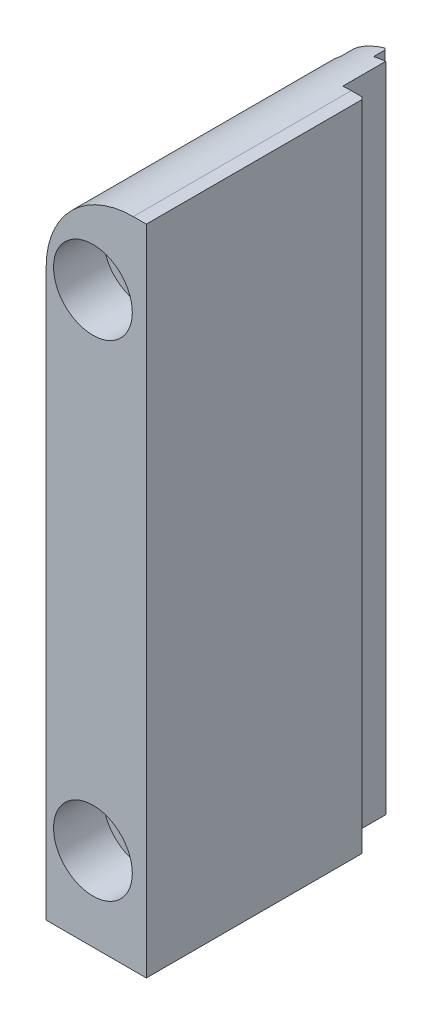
ISO-10303-21;
HEADER;
FILE_DESCRIPTION(('STEP AP214'),'2;1');
FILE_NAME('part.step','',(''),(''),'','','');
FILE_SCHEMA(('AUTOMOTIVE_DESIGN { 1 0 10303 214 1 1 1 1 }'));
ENDSEC;
DATA;
#1=APPLICATION_CONTEXT('core data for automotive mechanical design processes');
#2=APPLICATION_PROTOCOL_DEFINITION('international standard','automotive_design',2000,#1);
#3=PRODUCT_CONTEXT('',#1,'mechanical');
#4=PRODUCT('Part','Part','',(#3));
#5=PRODUCT_RELATED_PRODUCT_CATEGORY('part','',(#4));
#6=PRODUCT_DEFINITION_FORMATION('','',#4);
#7=PRODUCT_DEFINITION_CONTEXT('part definition',#1,'design');
#8=PRODUCT_DEFINITION('design','',#6,#7);
#9=PRODUCT_DEFINITION_SHAPE('','',#8);
#10=(LENGTH_UNIT() NAMED_UNIT(*) SI_UNIT(.MILLI.,.METRE.));
#11=(NAMED_UNIT(*) PLANE_ANGLE_UNIT() SI_UNIT($,.RADIAN.));
#12=(NAMED_UNIT(*) SI_UNIT($,.STERADIAN.) SOLID_ANGLE_UNIT());
#13=UNCERTAINTY_MEASURE_WITH_UNIT(LENGTH_MEASURE(1.E-05),#10,'distance_accuracy_value','');
#14=(GEOMETRIC_REPRESENTATION_CONTEXT(3) GLOBAL_UNCERTAINTY_ASSIGNED_CONTEXT((#13)) GLOBAL_UNIT_ASSIGNED_CONTEXT((#10,
#11,#12)) REPRESENTATION_CONTEXT('',''));
#15=CARTESIAN_POINT('',(0.,0.,0.));
#16=DIRECTION('',(0.,0.,1.));
#17=DIRECTION('',(1.,0.,0.));
#18=AXIS2_PLACEMENT_3D('',#15,#16,#17);
#19=CARTESIAN_POINT('',(-7.32028,29.845,-28.956));
#20=DIRECTION('',(0.,0.,-1.));
#21=DIRECTION('',(1.,0.,0.));
#22=AXIS2_PLACEMENT_3D('',#19,#20,#21);
#23=PLANE('',#22);
#24=CARTESIAN_POINT('',(-5.92328,-26.924,-28.956));
#25=DIRECTION('',(0.,0.,-1.));
#26=DIRECTION('',(-1.,0.,0.));
#27=AXIS2_PLACEMENT_3D('',#24,#25,#26);
#28=CIRCLE('',#27,2.7051);
#29=CARTESIAN_POINT('',(-8.62838,-26.924,-28.956));
#30=VERTEX_POINT('',#29);
#31=EDGE_CURVE('E291',#30,#30,#28,.T.);
#32=ORIENTED_EDGE('',*,*,#31,.F.);
#33=EDGE_LOOP('',(#32));
#34=FACE_BOUND('',#33,.T.);
#35=CARTESIAN_POINT('',(-5.92328,26.924,-28.956));
#36=DIRECTION('',(0.,0.,-1.));
#37=DIRECTION('',(-1.,0.,0.));
#38=AXIS2_PLACEMENT_3D('',#35,#36,#37);
#39=CIRCLE('',#38,2.7051);
#40=CARTESIAN_POINT('',(-8.62838,26.924,-28.956));
#41=VERTEX_POINT('',#40);
#42=EDGE_CURVE('E423',#41,#41,#39,.T.);
#43=ORIENTED_EDGE('',*,*,#42,.F.);
#44=EDGE_LOOP('',(#43));
#45=FACE_BOUND('',#44,.T.);
#46=CARTESIAN_POINT('',(-5.92328,26.924,-28.956));
#47=DIRECTION('',(0.,0.,1.));
#48=DIRECTION('',(1.,0.,0.));
#49=AXIS2_PLACEMENT_3D('',#46,#47,#48);
#50=CIRCLE('',#49,3.175);
#51=CARTESIAN_POINT('',(-2.74828,26.924,-28.956));
#52=VERTEX_POINT('',#51);
#53=CARTESIAN_POINT('',(-2.7482803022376,26.9226146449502,-28.956));
#54=VERTEX_POINT('',#53);
#55=EDGE_CURVE('E428',#52,#54,#50,.T.);
#56=ORIENTED_EDGE('',*,*,#55,.F.);
#57=DIRECTION('',(-1.,0.,0.));
#58=VECTOR('',#57,1.);
#59=CARTESIAN_POINT('',(-7.32028,26.924,-28.956));
#60=LINE('',#59,#58);
#61=CARTESIAN_POINT('',(-2.748026,26.924,-28.956));
#62=VERTEX_POINT('',#61);
#63=EDGE_CURVE('E476',#52,#62,#60,.F.);
#64=ORIENTED_EDGE('',*,*,#63,.T.);
#65=CARTESIAN_POINT('',(-5.92328,26.924,-28.956));
#66=DIRECTION('',(0.,0.,-1.));
#67=DIRECTION('',(-1.,0.,0.));
#68=AXIS2_PLACEMENT_3D('',#65,#66,#67);
#69=CIRCLE('',#68,3.175254);
#70=CARTESIAN_POINT('',(-3.76428,29.2522948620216,-28.956));
#71=VERTEX_POINT('',#70);
#72=EDGE_CURVE('E496',#71,#62,#69,.T.);
#73=ORIENTED_EDGE('',*,*,#72,.F.);
#74=DIRECTION('',(0.,-1.,0.));
#75=VECTOR('',#74,1.);
#76=CARTESIAN_POINT('',(-3.76428,29.845,-28.956));
#77=LINE('',#76,#75);
#78=CARTESIAN_POINT('',(-3.76428,35.9141543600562,-28.956));
#79=VERTEX_POINT('',#78);
#80=EDGE_CURVE('E365',#79,#71,#77,.T.);
#81=ORIENTED_EDGE('',*,*,#80,.F.);
#82=CARTESIAN_POINT('',(-1.45288,26.543,-28.956));
#83=DIRECTION('',(0.,0.,1.));
#84=DIRECTION('',(1.,0.,0.));
#85=AXIS2_PLACEMENT_3D('',#82,#83,#84);
#86=CIRCLE('',#85,9.652);
#87=CARTESIAN_POINT('',(-2.40538,36.1478866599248,-28.956));
#88=VERTEX_POINT('',#87);
#89=EDGE_CURVE('E334',#88,#79,#86,.T.);
#90=ORIENTED_EDGE('',*,*,#89,.F.);
#91=DIRECTION('',(0.,-1.,0.));
#92=VECTOR('',#91,1.);
#93=CARTESIAN_POINT('',(-2.40538,29.845,-28.956));
#94=LINE('',#93,#92);
#95=CARTESIAN_POINT('',(-2.40538,-36.195,-28.956));
#96=VERTEX_POINT('',#95);
#97=EDGE_CURVE('E368',#88,#96,#94,.T.);
#98=ORIENTED_EDGE('',*,*,#97,.T.);
#99=DIRECTION('',(-1.,0.,0.));
#100=VECTOR('',#99,1.);
#101=CARTESIAN_POINT('',(-11.07948,-36.195,-28.956));
#102=LINE('',#101,#100);
#103=CARTESIAN_POINT('',(-3.76428,-36.195,-28.956));
#104=VERTEX_POINT('',#103);
#105=EDGE_CURVE('E391',#96,#104,#102,.T.);
#106=ORIENTED_EDGE('',*,*,#105,.T.);
#107=CARTESIAN_POINT('',(-3.76428,-29.2522948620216,-28.956));
#108=VERTEX_POINT('',#107);
#109=EDGE_CURVE('E358',#108,#104,#77,.T.);
#110=ORIENTED_EDGE('',*,*,#109,.F.);
#111=CARTESIAN_POINT('',(-5.92328,-26.924,-28.956));
#112=DIRECTION('',(0.,0.,-1.));
#113=DIRECTION('',(-1.,0.,0.));
#114=AXIS2_PLACEMENT_3D('',#111,#112,#113);
#115=CIRCLE('',#114,3.175254);
#116=CARTESIAN_POINT('',(-2.74802630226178,-26.9253854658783,-28.956));
#117=VERTEX_POINT('',#116);
#118=EDGE_CURVE('E447',#117,#108,#115,.T.);
#119=ORIENTED_EDGE('',*,*,#118,.F.);
#120=DIRECTION('',(-0.999999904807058,0.000436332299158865,0.));
#121=VECTOR('',#120,1.);
#122=CARTESIAN_POINT('',(-7.34504987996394,-26.9233796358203,-28.956));
#123=LINE('',#122,#121);
#124=CARTESIAN_POINT('',(-2.7482803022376,-26.9253853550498,-28.956));
#125=VERTEX_POINT('',#124);
#126=EDGE_CURVE('E433',#117,#125,#123,.T.);
#127=ORIENTED_EDGE('',*,*,#126,.T.);
#128=CARTESIAN_POINT('',(-5.92328,-26.924,-28.956));
#129=DIRECTION('',(0.,0.,1.));
#130=DIRECTION('',(1.,0.,0.));
#131=AXIS2_PLACEMENT_3D('',#128,#129,#130);
#132=CIRCLE('',#131,3.175);
#133=CARTESIAN_POINT('',(-2.74828,-26.924,-28.956));
#134=VERTEX_POINT('',#133);
#135=EDGE_CURVE('E426',#134,#125,#132,.T.);
#136=ORIENTED_EDGE('',*,*,#135,.F.);
#137=DIRECTION('',(-1.,0.,0.));
#138=VECTOR('',#137,1.);
#139=CARTESIAN_POINT('',(-7.32028,-26.924,-28.956));
#140=LINE('',#139,#138);
#141=CARTESIAN_POINT('',(-2.748026,-26.924,-28.956));
#142=VERTEX_POINT('',#141);
#143=EDGE_CURVE('E430',#134,#142,#140,.F.);
#144=ORIENTED_EDGE('',*,*,#143,.T.);
#145=CARTESIAN_POINT('',(-3.76428,-24.5957051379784,-28.956));
#146=VERTEX_POINT('',#145);
#147=EDGE_CURVE('E436',#146,#142,#115,.T.);
#148=ORIENTED_EDGE('',*,*,#147,.F.);
#149=CARTESIAN_POINT('',(-3.76428,24.5957051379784,-28.956));
#150=VERTEX_POINT('',#149);
#151=EDGE_CURVE('E369',#150,#146,#77,.T.);
#152=ORIENTED_EDGE('',*,*,#151,.F.);
#153=CARTESIAN_POINT('',(-2.74802630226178,26.9226145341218,-28.956));
#154=VERTEX_POINT('',#153);
#155=EDGE_CURVE('E480',#154,#150,#69,.T.);
#156=ORIENTED_EDGE('',*,*,#155,.F.);
#157=DIRECTION('',(-0.999999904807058,0.000436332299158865,0.));
#158=VECTOR('',#157,1.);
#159=CARTESIAN_POINT('',(-7.32155426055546,26.9246101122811,-28.956));
#160=LINE('',#159,#158);
#161=EDGE_CURVE('E249',#154,#54,#160,.T.);
#162=ORIENTED_EDGE('',*,*,#161,.T.);
#163=EDGE_LOOP('',(#56,#64,#73,#81,#90,#98,#106,#110,#119,#127,#136,#144,#148,#152,#156,#162));
#164=FACE_BOUND('',#163,.T.);
#165=ADVANCED_FACE('F15',(#34,#45,#164),#23,.T.);
#166=CARTESIAN_POINT('',(-5.92328,26.924,-18.5166));
#167=DIRECTION('',(0.,0.,1.));
#168=DIRECTION('',(1.,0.,0.));
#169=AXIS2_PLACEMENT_3D('',#166,#167,#168);
#170=CONICAL_SURFACE('',#169,3.3147,0.785398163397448);
#171=CARTESIAN_POINT('',(-5.92328,26.924,-19.1262));
#172=DIRECTION('',(0.,0.,1.));
#173=DIRECTION('',(1.,0.,0.));
#174=AXIS2_PLACEMENT_3D('',#171,#172,#173);
#175=CIRCLE('',#174,2.7051);
#176=CARTESIAN_POINT('',(-3.21818,26.924,-19.1262));
#177=VERTEX_POINT('',#176);
#178=EDGE_CURVE('E276',#177,#177,#175,.T.);
#179=ORIENTED_EDGE('',*,*,#178,.F.);
#180=EDGE_LOOP('',(#179));
#181=FACE_BOUND('',#180,.T.);
#182=CARTESIAN_POINT('',(-5.92328,26.924,-18.5166));
#183=DIRECTION('',(0.,0.,-1.));
#184=DIRECTION('',(-1.,0.,0.));
#185=AXIS2_PLACEMENT_3D('',#182,#183,#184);
#186=CIRCLE('',#185,3.3147);
#187=CARTESIAN_POINT('',(-9.23798,26.924,-18.5166));
#188=VERTEX_POINT('',#187);
#189=EDGE_CURVE('E288',#188,#188,#186,.T.);
#190=ORIENTED_EDGE('',*,*,#189,.F.);
#191=EDGE_LOOP('',(#190));
#192=FACE_BOUND('',#191,.T.);
#193=CARTESIAN_POINT('',(-5.92328,26.924,-18.6563));
#194=DIRECTION('',(0.,0.,1.));
#195=DIRECTION('',(1.,0.,0.));
#196=AXIS2_PLACEMENT_3D('',#193,#194,#195);
#197=CIRCLE('',#196,3.175);
#198=CARTESIAN_POINT('',(-2.7482803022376,26.9226146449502,-18.6563));
#199=VERTEX_POINT('',#198);
#200=CARTESIAN_POINT('',(-2.74828,26.924,-18.6563));
#201=VERTEX_POINT('',#200);
#202=EDGE_CURVE('E9',#199,#201,#197,.F.);
#203=ORIENTED_EDGE('',*,*,#202,.F.);
#204=DIRECTION('',(0.707106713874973,-0.000308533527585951,0.707106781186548));
#205=VECTOR('',#204,1.);
#206=CARTESIAN_POINT('',(-5.92328,26.924,-21.8313));
#207=LINE('',#206,#205);
#208=CARTESIAN_POINT('',(-2.74802630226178,26.9226145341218,-18.656046));
#209=VERTEX_POINT('',#208);
#210=EDGE_CURVE('E241',#209,#199,#207,.F.);
#211=ORIENTED_EDGE('',*,*,#210,.F.);
#212=CARTESIAN_POINT('',(-5.92328,26.924,-18.656046));
#213=DIRECTION('',(0.,0.,1.));
#214=DIRECTION('',(1.,0.,0.));
#215=AXIS2_PLACEMENT_3D('',#212,#213,#214);
#216=CIRCLE('',#215,3.175254);
#217=CARTESIAN_POINT('',(-2.748026,26.924,-18.656046));
#218=VERTEX_POINT('',#217);
#219=EDGE_CURVE('E233',#209,#218,#216,.F.);
#220=ORIENTED_EDGE('',*,*,#219,.T.);
#221=DIRECTION('',(0.707106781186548,0.,0.707106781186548));
#222=VECTOR('',#221,1.);
#223=CARTESIAN_POINT('',(-5.92328,26.924,-21.8313));
#224=LINE('',#223,#222);
#225=EDGE_CURVE('E23',#201,#218,#224,.T.);
#226=ORIENTED_EDGE('',*,*,#225,.F.);
#227=EDGE_LOOP('',(#203,#211,#220,#226));
#228=FACE_BOUND('',#227,.T.);
#229=ADVANCED_FACE('F252',(#181,#192,#228),#170,.F.);
#230=CARTESIAN_POINT('',(-7.32028,24.0725742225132,-28.956));
#231=VERTEX_POINT('',#230);
#232=CARTESIAN_POINT('',(-7.32028,29.7754257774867,-28.956));
#233=VERTEX_POINT('',#232);
#234=EDGE_CURVE('E491',#231,#233,#69,.T.);
#235=ORIENTED_EDGE('',*,*,#234,.F.);
#236=DIRECTION('',(0.,-1.,0.));
#237=VECTOR('',#236,1.);
#238=CARTESIAN_POINT('',(-7.32028,29.845,-28.956));
#239=LINE('',#238,#237);
#240=CARTESIAN_POINT('',(-7.32028,-24.0725742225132,-28.956));
#241=VERTEX_POINT('',#240);
#242=EDGE_CURVE('E359',#231,#241,#239,.T.);
#243=ORIENTED_EDGE('',*,*,#242,.T.);
#244=CARTESIAN_POINT('',(-7.32028,-29.7754257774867,-28.956));
#245=VERTEX_POINT('',#244);
#246=EDGE_CURVE('E453',#245,#241,#115,.T.);
#247=ORIENTED_EDGE('',*,*,#246,.F.);
#248=CARTESIAN_POINT('',(-7.32028,-36.195,-28.956));
#249=VERTEX_POINT('',#248);
#250=EDGE_CURVE('E360',#245,#249,#239,.T.);
#251=ORIENTED_EDGE('',*,*,#250,.T.);
#252=DIRECTION('',(-1.,0.,0.));
#253=VECTOR('',#252,1.);
#254=CARTESIAN_POINT('',(-11.07948,-36.195,-28.956));
#255=LINE('',#254,#253);
#256=CARTESIAN_POINT('',(-11.10488,-36.195,-28.956));
#257=VERTEX_POINT('',#256);
#258=EDGE_CURVE('E320',#249,#257,#255,.T.);
#259=ORIENTED_EDGE('',*,*,#258,.T.);
#260=DIRECTION('',(0.,-1.,0.));
#261=VECTOR('',#260,1.);
#262=CARTESIAN_POINT('',(-11.10488,29.845,-28.956));
#263=LINE('',#262,#261);
#264=CARTESIAN_POINT('',(-11.10488,26.543,-28.956));
#265=VERTEX_POINT('',#264);
#266=EDGE_CURVE('E327',#265,#257,#263,.T.);
#267=ORIENTED_EDGE('',*,*,#266,.F.);
#268=CARTESIAN_POINT('',(-1.45288,26.543,-28.956));
#269=DIRECTION('',(0.,0.,1.));
#270=DIRECTION('',(1.,0.,0.));
#271=AXIS2_PLACEMENT_3D('',#268,#269,#270);
#272=CIRCLE('',#271,9.652);
#273=CARTESIAN_POINT('',(-7.32028,34.2068581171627,-28.956));
#274=VERTEX_POINT('',#273);
#275=EDGE_CURVE('E303',#274,#265,#272,.T.);
#276=ORIENTED_EDGE('',*,*,#275,.F.);
#277=EDGE_CURVE('E355',#274,#233,#239,.T.);
#278=ORIENTED_EDGE('',*,*,#277,.T.);
#279=EDGE_LOOP('',(#235,#243,#247,#251,#259,#267,#276,#278));
#280=FACE_BOUND('',#279,.T.);
#281=ADVANCED_FACE('F529',(#280),#23,.T.);
#282=CARTESIAN_POINT('',(-5.92328,-26.924,-18.5166));
#283=DIRECTION('',(0.,0.,1.));
#284=DIRECTION('',(1.,0.,0.));
#285=AXIS2_PLACEMENT_3D('',#282,#283,#284);
#286=CONICAL_SURFACE('',#285,3.3147,0.785398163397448);
#287=CARTESIAN_POINT('',(-5.92328,-26.924,-19.1262));
#288=DIRECTION('',(0.,0.,1.));
#289=DIRECTION('',(1.,0.,0.));
#290=AXIS2_PLACEMENT_3D('',#287,#288,#289);
#291=CIRCLE('',#290,2.7051);
#292=CARTESIAN_POINT('',(-3.21818,-26.924,-19.1262));
#293=VERTEX_POINT('',#292);
#294=EDGE_CURVE('E269',#293,#293,#291,.T.);
#295=ORIENTED_EDGE('',*,*,#294,.F.);
#296=EDGE_LOOP('',(#295));
#297=FACE_BOUND('',#296,.T.);
#298=CARTESIAN_POINT('',(-5.92328,-26.924,-18.5166));
#299=DIRECTION('',(0.,0.,-1.));
#300=DIRECTION('',(-1.,0.,0.));
#301=AXIS2_PLACEMENT_3D('',#298,#299,#300);
#302=CIRCLE('',#301,3.3147);
#303=CARTESIAN_POINT('',(-9.23798,-26.924,-18.5166));
#304=VERTEX_POINT('',#303);
#305=EDGE_CURVE('E273',#304,#304,#302,.T.);
#306=ORIENTED_EDGE('',*,*,#305,.F.);
#307=EDGE_LOOP('',(#306));
#308=FACE_BOUND('',#307,.T.);
#309=CARTESIAN_POINT('',(-5.92328,-26.924,-18.6563));
#310=DIRECTION('',(0.,0.,1.));
#311=DIRECTION('',(1.,0.,0.));
#312=AXIS2_PLACEMENT_3D('',#309,#310,#311);
#313=CIRCLE('',#312,3.175);
#314=CARTESIAN_POINT('',(-2.7482803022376,-26.9253853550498,-18.6563));
#315=VERTEX_POINT('',#314);
#316=CARTESIAN_POINT('',(-2.74828,-26.924,-18.6563));
#317=VERTEX_POINT('',#316);
#318=EDGE_CURVE('E242',#315,#317,#313,.F.);
#319=ORIENTED_EDGE('',*,*,#318,.F.);
#320=DIRECTION('',(0.707106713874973,-0.000308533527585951,0.707106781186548));
#321=VECTOR('',#320,1.);
#322=CARTESIAN_POINT('',(-5.92328,-26.924,-21.8313));
#323=LINE('',#322,#321);
#324=CARTESIAN_POINT('',(-2.74802630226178,-26.9253854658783,-18.656046));
#325=VERTEX_POINT('',#324);
#326=EDGE_CURVE('E259',#325,#315,#323,.F.);
#327=ORIENTED_EDGE('',*,*,#326,.F.);
#328=CARTESIAN_POINT('',(-5.92328,-26.924,-18.656046));
#329=DIRECTION('',(0.,0.,1.));
#330=DIRECTION('',(1.,0.,0.));
#331=AXIS2_PLACEMENT_3D('',#328,#329,#330);
#332=CIRCLE('',#331,3.175254);
#333=CARTESIAN_POINT('',(-2.748026,-26.924,-18.656046));
#334=VERTEX_POINT('',#333);
#335=EDGE_CURVE('E261',#325,#334,#332,.F.);
#336=ORIENTED_EDGE('',*,*,#335,.T.);
#337=DIRECTION('',(0.707106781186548,0.,0.707106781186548));
#338=VECTOR('',#337,1.);
#339=CARTESIAN_POINT('',(-5.92328,-26.924,-21.8313));
#340=LINE('',#339,#338);
#341=EDGE_CURVE('E256',#317,#334,#340,.T.);
#342=ORIENTED_EDGE('',*,*,#341,.F.);
#343=EDGE_LOOP('',(#319,#327,#336,#342));
#344=FACE_BOUND('',#343,.T.);
#345=ADVANCED_FACE('F17',(#297,#308,#344),#286,.F.);
#346=CARTESIAN_POINT('',(-3.76428,29.845,-28.956));
#347=DIRECTION('',(1.,0.,0.));
#348=DIRECTION('',(0.,0.,1.));
#349=AXIS2_PLACEMENT_3D('',#346,#347,#348);
#350=PLANE('',#349);
#351=DIRECTION('',(0.,0.,1.));
#352=VECTOR('',#351,1.);
#353=CARTESIAN_POINT('',(-3.76428,29.2522948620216,-18.5166));
#354=LINE('',#353,#352);
#355=CARTESIAN_POINT('',(-3.76428,29.2522948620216,-30.226));
#356=VERTEX_POINT('',#355);
#357=EDGE_CURVE('E498',#356,#71,#354,.T.);
#358=ORIENTED_EDGE('',*,*,#357,.F.);
#359=DIRECTION('',(0.,1.,0.));
#360=VECTOR('',#359,1.);
#361=CARTESIAN_POINT('',(-3.76428,29.845,-30.226));
#362=LINE('',#361,#360);
#363=CARTESIAN_POINT('',(-3.76428,35.9141543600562,-30.226));
#364=VERTEX_POINT('',#363);
#365=EDGE_CURVE('E299',#356,#364,#362,.T.);
#366=ORIENTED_EDGE('',*,*,#365,.T.);
#367=DIRECTION('',(0.,0.,1.));
#368=VECTOR('',#367,1.);
#369=CARTESIAN_POINT('',(-3.76428,35.9141543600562,-28.956));
#370=LINE('',#369,#368);
#371=EDGE_CURVE('E337',#79,#364,#370,.F.);
#372=ORIENTED_EDGE('',*,*,#371,.F.);
#373=ORIENTED_EDGE('',*,*,#80,.T.);
#374=EDGE_LOOP('',(#358,#366,#372,#373));
#375=FACE_BOUND('',#374,.T.);
#376=ADVANCED_FACE('F544',(#375),#350,.T.);
#377=CARTESIAN_POINT('',(-3.76428,29.845,-30.48));
#378=DIRECTION('',(0.,0.,-1.));
#379=DIRECTION('',(1.,0.,0.));
#380=AXIS2_PLACEMENT_3D('',#377,#378,#379);
#381=PLANE('',#380);
#382=CARTESIAN_POINT('',(-5.92328,26.924,-30.48));
#383=DIRECTION('',(0.,0.,-1.));
#384=DIRECTION('',(-1.,0.,0.));
#385=AXIS2_PLACEMENT_3D('',#382,#383,#384);
#386=CIRCLE('',#385,3.175254);
#387=CARTESIAN_POINT('',(-7.06628,29.886395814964,-30.48));
#388=VERTEX_POINT('',#387);
#389=CARTESIAN_POINT('',(-4.01828,29.4643174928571,-30.48));
#390=VERTEX_POINT('',#389);
#391=EDGE_CURVE('E30',#388,#390,#386,.T.);
#392=ORIENTED_EDGE('',*,*,#391,.F.);
#393=DIRECTION('',(0.,1.,0.));
#394=VECTOR('',#393,1.);
#395=CARTESIAN_POINT('',(-7.06628,29.845,-30.48));
#396=LINE('',#395,#394);
#397=CARTESIAN_POINT('',(-7.06628,34.3948051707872,-30.48));
#398=VERTEX_POINT('',#397);
#399=EDGE_CURVE('E349',#388,#398,#396,.T.);
#400=ORIENTED_EDGE('',*,*,#399,.T.);
#401=CARTESIAN_POINT('',(-1.45288,26.543,-30.48));
#402=DIRECTION('',(0.,0.,1.));
#403=DIRECTION('',(1.,0.,0.));
#404=AXIS2_PLACEMENT_3D('',#401,#402,#403);
#405=CIRCLE('',#404,9.652);
#406=CARTESIAN_POINT('',(-4.01828,35.8478281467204,-30.48));
#407=VERTEX_POINT('',#406);
#408=EDGE_CURVE('E304',#407,#398,#405,.T.);
#409=ORIENTED_EDGE('',*,*,#408,.F.);
#410=DIRECTION('',(0.,-1.,0.));
#411=VECTOR('',#410,1.);
#412=CARTESIAN_POINT('',(-4.01828,29.845,-30.48));
#413=LINE('',#412,#411);
#414=EDGE_CURVE('E375',#407,#390,#413,.T.);
#415=ORIENTED_EDGE('',*,*,#414,.T.);
#416=EDGE_LOOP('',(#392,#400,#409,#415));
#417=FACE_BOUND('',#416,.T.);
#418=ADVANCED_FACE('F584',(#417),#381,.T.);
#419=CARTESIAN_POINT('',(-7.32028,29.845,-30.226));
#420=DIRECTION('',(0.707106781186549,0.,0.707106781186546));
#421=DIRECTION('',(0.707106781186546,0.,-0.707106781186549));
#422=AXIS2_PLACEMENT_3D('',#419,#420,#421);
#423=PLANE('',#422);
#424=CARTESIAN_POINT('',(-5.92328,26.924,-31.623));
#425=DIRECTION('',(0.707106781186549,0.,0.707106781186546));
#426=DIRECTION('',(-0.707106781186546,0.,0.707106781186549));
#427=AXIS2_PLACEMENT_3D('',#424,#425,#426);
#428=ELLIPSE('',#427,4.49048727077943,3.175254);
#429=CARTESIAN_POINT('',(-7.32028,29.7754257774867,-30.226));
#430=VERTEX_POINT('',#429);
#431=EDGE_CURVE('E494',#430,#388,#428,.F.);
#432=ORIENTED_EDGE('',*,*,#431,.F.);
#433=DIRECTION('',(0.,-1.,0.));
#434=VECTOR('',#433,1.);
#435=CARTESIAN_POINT('',(-7.32028,29.845,-30.226));
#436=LINE('',#435,#434);
#437=CARTESIAN_POINT('',(-7.32028,34.2068581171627,-30.226));
#438=VERTEX_POINT('',#437);
#439=EDGE_CURVE('E350',#438,#430,#436,.T.);
#440=ORIENTED_EDGE('',*,*,#439,.F.);
#441=CARTESIAN_POINT('',(-1.45288,26.543,-36.0934));
#442=DIRECTION('',(0.707106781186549,0.,0.707106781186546));
#443=DIRECTION('',(-0.707106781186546,0.,0.707106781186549));
#444=AXIS2_PLACEMENT_3D('',#441,#442,#443);
#445=ELLIPSE('',#444,13.6499893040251,9.652);
#446=EDGE_CURVE('E297',#398,#438,#445,.T.);
#447=ORIENTED_EDGE('',*,*,#446,.F.);
#448=ORIENTED_EDGE('',*,*,#399,.F.);
#449=EDGE_LOOP('',(#432,#440,#447,#448));
#450=FACE_BOUND('',#449,.T.);
#451=ADVANCED_FACE('F581',(#450),#423,.F.);
#452=CARTESIAN_POINT('',(-7.32028,29.845,-30.48));
#453=DIRECTION('',(-1.,0.,0.));
#454=DIRECTION('',(0.,0.,-1.));
#455=AXIS2_PLACEMENT_3D('',#452,#453,#454);
#456=PLANE('',#455);
#457=DIRECTION('',(0.,0.,1.));
#458=VECTOR('',#457,1.);
#459=CARTESIAN_POINT('',(-7.32028,24.0725742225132,-18.5166));
#460=LINE('',#459,#458);
#461=CARTESIAN_POINT('',(-7.32028,24.0725742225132,-30.226));
#462=VERTEX_POINT('',#461);
#463=EDGE_CURVE('E489',#462,#231,#460,.T.);
#464=ORIENTED_EDGE('',*,*,#463,.F.);
#465=CARTESIAN_POINT('',(-7.32028,-24.0725742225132,-30.226));
#466=VERTEX_POINT('',#465);
#467=EDGE_CURVE('E354',#462,#466,#436,.T.);
#468=ORIENTED_EDGE('',*,*,#467,.T.);
#469=DIRECTION('',(0.,0.,1.));
#470=VECTOR('',#469,1.);
#471=CARTESIAN_POINT('',(-7.32028,-24.0725742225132,-18.5166));
#472=LINE('',#471,#470);
#473=EDGE_CURVE('E448',#241,#466,#472,.F.);
#474=ORIENTED_EDGE('',*,*,#473,.F.);
#475=ORIENTED_EDGE('',*,*,#242,.F.);
#476=EDGE_LOOP('',(#464,#468,#474,#475));
#477=FACE_BOUND('',#476,.T.);
#478=ADVANCED_FACE('F555',(#477),#456,.T.);
#479=CARTESIAN_POINT('',(-4.01828,29.845,-30.48));
#480=DIRECTION('',(-0.707106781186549,0.,0.707106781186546));
#481=DIRECTION('',(0.707106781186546,0.,0.707106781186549));
#482=AXIS2_PLACEMENT_3D('',#479,#480,#481);
#483=PLANE('',#482);
#484=CARTESIAN_POINT('',(-5.92328,26.924,-32.385));
#485=DIRECTION('',(-0.707106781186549,0.,0.707106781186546));
#486=DIRECTION('',(0.707106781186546,0.,0.707106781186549));
#487=AXIS2_PLACEMENT_3D('',#484,#485,#486);
#488=ELLIPSE('',#487,4.49048727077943,3.175254);
#489=CARTESIAN_POINT('',(-3.76428,24.5957051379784,-30.226));
#490=VERTEX_POINT('',#489);
#491=CARTESIAN_POINT('',(-4.01828,24.3836825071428,-30.48));
#492=VERTEX_POINT('',#491);
#493=EDGE_CURVE('E483',#490,#492,#488,.F.);
#494=ORIENTED_EDGE('',*,*,#493,.F.);
#495=CARTESIAN_POINT('',(-3.76428,-24.5957051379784,-30.226));
#496=VERTEX_POINT('',#495);
#497=EDGE_CURVE('E374',#496,#490,#362,.T.);
#498=ORIENTED_EDGE('',*,*,#497,.F.);
#499=CARTESIAN_POINT('',(-5.92328,-26.924,-32.385));
#500=DIRECTION('',(-0.707106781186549,0.,0.707106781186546));
#501=DIRECTION('',(0.707106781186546,0.,0.707106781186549));
#502=AXIS2_PLACEMENT_3D('',#499,#500,#501);
#503=ELLIPSE('',#502,4.49048727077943,3.175254);
#504=CARTESIAN_POINT('',(-4.01828,-24.3836825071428,-30.48));
#505=VERTEX_POINT('',#504);
#506=EDGE_CURVE('E440',#505,#496,#503,.F.);
#507=ORIENTED_EDGE('',*,*,#506,.F.);
#508=EDGE_CURVE('E378',#492,#505,#413,.T.);
#509=ORIENTED_EDGE('',*,*,#508,.F.);
#510=EDGE_LOOP('',(#494,#498,#507,#509));
#511=FACE_BOUND('',#510,.T.);
#512=ADVANCED_FACE('F647',(#511),#483,.F.);
#513=DIRECTION('',(0.,0.,1.));
#514=VECTOR('',#513,1.);
#515=CARTESIAN_POINT('',(-3.76428,24.5957051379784,-18.5166));
#516=LINE('',#515,#514);
#517=EDGE_CURVE('E481',#150,#490,#516,.F.);
#518=ORIENTED_EDGE('',*,*,#517,.F.);
#519=ORIENTED_EDGE('',*,*,#151,.T.);
#520=DIRECTION('',(0.,0.,1.));
#521=VECTOR('',#520,1.);
#522=CARTESIAN_POINT('',(-3.76428,-24.5957051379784,-18.5166));
#523=LINE('',#522,#521);
#524=EDGE_CURVE('E437',#496,#146,#523,.T.);
#525=ORIENTED_EDGE('',*,*,#524,.F.);
#526=ORIENTED_EDGE('',*,*,#497,.T.);
#527=EDGE_LOOP('',(#518,#519,#525,#526));
#528=FACE_BOUND('',#527,.T.);
#529=ADVANCED_FACE('F610',(#528),#350,.T.);
#530=CARTESIAN_POINT('',(-5.92328,26.924,-30.48));
#531=DIRECTION('',(0.,0.,-1.));
#532=DIRECTION('',(-1.,0.,0.));
#533=AXIS2_PLACEMENT_3D('',#530,#531,#532);
#534=CIRCLE('',#533,3.175254);
#535=CARTESIAN_POINT('',(-7.06628,23.961604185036,-30.48));
#536=VERTEX_POINT('',#535);
#537=EDGE_CURVE('E485',#492,#536,#534,.T.);
#538=ORIENTED_EDGE('',*,*,#537,.F.);
#539=ORIENTED_EDGE('',*,*,#508,.T.);
#540=CARTESIAN_POINT('',(-5.92328,-26.924,-30.48));
#541=DIRECTION('',(0.,0.,-1.));
#542=DIRECTION('',(-1.,0.,0.));
#543=AXIS2_PLACEMENT_3D('',#540,#541,#542);
#544=CIRCLE('',#543,3.175254);
#545=CARTESIAN_POINT('',(-7.06628,-23.961604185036,-30.48));
#546=VERTEX_POINT('',#545);
#547=EDGE_CURVE('E442',#546,#505,#544,.T.);
#548=ORIENTED_EDGE('',*,*,#547,.F.);
#549=EDGE_CURVE('E348',#546,#536,#396,.T.);
#550=ORIENTED_EDGE('',*,*,#549,.T.);
#551=EDGE_LOOP('',(#538,#539,#548,#550));
#552=FACE_BOUND('',#551,.T.);
#553=ADVANCED_FACE('F643',(#552),#381,.T.);
#554=DIRECTION('',(0.,0.,1.));
#555=VECTOR('',#554,1.);
#556=CARTESIAN_POINT('',(-7.32028,-29.7754257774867,-18.5166));
#557=LINE('',#556,#555);
#558=CARTESIAN_POINT('',(-7.32028,-29.7754257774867,-30.226));
#559=VERTEX_POINT('',#558);
#560=EDGE_CURVE('E456',#559,#245,#557,.T.);
#561=ORIENTED_EDGE('',*,*,#560,.F.);
#562=CARTESIAN_POINT('',(-7.32028,-36.195,-30.226));
#563=VERTEX_POINT('',#562);
#564=EDGE_CURVE('E307',#559,#563,#436,.T.);
#565=ORIENTED_EDGE('',*,*,#564,.T.);
#566=DIRECTION('',(0.,0.,1.));
#567=VECTOR('',#566,1.);
#568=CARTESIAN_POINT('',(-7.32028,-36.195,-24.1808));
#569=LINE('',#568,#567);
#570=EDGE_CURVE('E386',#563,#249,#569,.T.);
#571=ORIENTED_EDGE('',*,*,#570,.T.);
#572=ORIENTED_EDGE('',*,*,#250,.F.);
#573=EDGE_LOOP('',(#561,#565,#571,#572));
#574=FACE_BOUND('',#573,.T.);
#575=ADVANCED_FACE('F562',(#574),#456,.T.);
#576=CARTESIAN_POINT('',(-5.92328,26.924,-31.623));
#577=DIRECTION('',(0.707106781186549,0.,0.707106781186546));
#578=DIRECTION('',(-0.707106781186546,0.,0.707106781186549));
#579=AXIS2_PLACEMENT_3D('',#576,#577,#578);
#580=ELLIPSE('',#579,4.49048727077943,3.175254);
#581=EDGE_CURVE('E487',#536,#462,#580,.F.);
#582=ORIENTED_EDGE('',*,*,#581,.F.);
#583=ORIENTED_EDGE('',*,*,#549,.F.);
#584=CARTESIAN_POINT('',(-5.92328,-26.924,-31.623));
#585=DIRECTION('',(0.707106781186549,0.,0.707106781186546));
#586=DIRECTION('',(-0.707106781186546,0.,0.707106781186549));
#587=AXIS2_PLACEMENT_3D('',#584,#585,#586);
#588=ELLIPSE('',#587,4.49048727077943,3.175254);
#589=EDGE_CURVE('E445',#466,#546,#588,.F.);
#590=ORIENTED_EDGE('',*,*,#589,.F.);
#591=ORIENTED_EDGE('',*,*,#467,.F.);
#592=EDGE_LOOP('',(#582,#583,#590,#591));
#593=FACE_BOUND('',#592,.T.);
#594=ADVANCED_FACE('F639',(#593),#423,.F.);
#595=CARTESIAN_POINT('',(-5.92328,-26.924,-32.385));
#596=DIRECTION('',(-0.707106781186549,0.,0.707106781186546));
#597=DIRECTION('',(0.707106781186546,0.,0.707106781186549));
#598=AXIS2_PLACEMENT_3D('',#595,#596,#597);
#599=ELLIPSE('',#598,4.49048727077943,3.175254);
#600=CARTESIAN_POINT('',(-3.76428,-29.2522948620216,-30.226));
#601=VERTEX_POINT('',#600);
#602=CARTESIAN_POINT('',(-4.01828,-29.4643174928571,-30.48));
#603=VERTEX_POINT('',#602);
#604=EDGE_CURVE('E458',#601,#603,#599,.F.);
#605=ORIENTED_EDGE('',*,*,#604,.F.);
#606=CARTESIAN_POINT('',(-3.76428,-36.195,-30.226));
#607=VERTEX_POINT('',#606);
#608=EDGE_CURVE('E370',#607,#601,#362,.T.);
#609=ORIENTED_EDGE('',*,*,#608,.F.);
#610=DIRECTION('',(-0.707106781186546,0.,-0.707106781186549));
#611=VECTOR('',#610,1.);
#612=CARTESIAN_POINT('',(-4.01828,-36.195,-30.48));
#613=LINE('',#612,#611);
#614=CARTESIAN_POINT('',(-4.01828,-36.195,-30.48));
#615=VERTEX_POINT('',#614);
#616=EDGE_CURVE('E382',#615,#607,#613,.F.);
#617=ORIENTED_EDGE('',*,*,#616,.F.);
#618=EDGE_CURVE('E379',#603,#615,#413,.T.);
#619=ORIENTED_EDGE('',*,*,#618,.F.);
#620=EDGE_LOOP('',(#605,#609,#617,#619));
#621=FACE_BOUND('',#620,.T.);
#622=ADVANCED_FACE('F624',(#621),#483,.F.);
#623=CARTESIAN_POINT('',(-5.92328,26.924,-12.7));
#624=DIRECTION('',(0.,0.,-1.));
#625=DIRECTION('',(-1.,0.,0.));
#626=AXIS2_PLACEMENT_3D('',#623,#624,#625);
#627=CYLINDRICAL_SURFACE('',#626,2.7051);
#628=ORIENTED_EDGE('',*,*,#178,.T.);
#629=EDGE_LOOP('',(#628));
#630=FACE_BOUND('',#629,.T.);
#631=ORIENTED_EDGE('',*,*,#42,.T.);
#632=EDGE_LOOP('',(#631));
#633=FACE_BOUND('',#632,.T.);
#634=ADVANCED_FACE('F657',(#630,#633),#627,.F.);
#635=CARTESIAN_POINT('',(-5.92328,-26.924,-12.7));
#636=DIRECTION('',(0.,0.,-1.));
#637=DIRECTION('',(-1.,0.,0.));
#638=AXIS2_PLACEMENT_3D('',#635,#636,#637);
#639=CYLINDRICAL_SURFACE('',#638,2.7051);
#640=ORIENTED_EDGE('',*,*,#294,.T.);
#641=EDGE_LOOP('',(#640));
#642=FACE_BOUND('',#641,.T.);
#643=ORIENTED_EDGE('',*,*,#31,.T.);
#644=EDGE_LOOP('',(#643));
#645=FACE_BOUND('',#644,.T.);
#646=ADVANCED_FACE('F705',(#642,#645),#639,.F.);
#647=CARTESIAN_POINT('',(-11.10488,29.845,-28.956));
#648=DIRECTION('',(-1.,0.,0.));
#649=DIRECTION('',(0.,0.,-1.));
#650=AXIS2_PLACEMENT_3D('',#647,#648,#649);
#651=PLANE('',#650);
#652=ORIENTED_EDGE('',*,*,#266,.T.);
#653=DIRECTION('',(0.,0.,1.));
#654=VECTOR('',#653,1.);
#655=CARTESIAN_POINT('',(-11.10488,-36.195,-24.1808));
#656=LINE('',#655,#654);
#657=CARTESIAN_POINT('',(-11.10488,-36.195,0.));
#658=VERTEX_POINT('',#657);
#659=EDGE_CURVE('E296',#257,#658,#656,.T.);
#660=ORIENTED_EDGE('',*,*,#659,.T.);
#661=DIRECTION('',(0.,-1.,0.));
#662=VECTOR('',#661,1.);
#663=CARTESIAN_POINT('',(-11.10488,29.845,0.));
#664=LINE('',#663,#662);
#665=CARTESIAN_POINT('',(-11.10488,26.543,0.));
#666=VERTEX_POINT('',#665);
#667=EDGE_CURVE('E312',#666,#658,#664,.T.);
#668=ORIENTED_EDGE('',*,*,#667,.F.);
#669=DIRECTION('',(0.,0.,1.));
#670=VECTOR('',#669,1.);
#671=CARTESIAN_POINT('',(-11.10488,26.543,-28.956));
#672=LINE('',#671,#670);
#673=EDGE_CURVE('E308',#265,#666,#672,.T.);
#674=ORIENTED_EDGE('',*,*,#673,.F.);
#675=EDGE_LOOP('',(#652,#660,#668,#674));
#676=FACE_BOUND('',#675,.T.);
#677=ADVANCED_FACE('F570',(#676),#651,.T.);
#678=CARTESIAN_POINT('',(-11.07948,29.845,0.));
#679=DIRECTION('',(0.,0.,1.));
#680=DIRECTION('',(-1.,0.,0.));
#681=AXIS2_PLACEMENT_3D('',#678,#679,#680);
#682=PLANE('',#681);
#683=CARTESIAN_POINT('',(-5.92328,-26.924,0.));
#684=DIRECTION('',(0.,0.,1.));
#685=DIRECTION('',(1.,0.,0.));
#686=AXIS2_PLACEMENT_3D('',#683,#684,#685);
#687=CIRCLE('',#686,4.365625);
#688=CARTESIAN_POINT('',(-1.557655,-26.924,0.));
#689=VERTEX_POINT('',#688);
#690=EDGE_CURVE('E265',#689,#689,#687,.F.);
#691=ORIENTED_EDGE('',*,*,#690,.T.);
#692=EDGE_LOOP('',(#691));
#693=FACE_BOUND('',#692,.T.);
#694=CARTESIAN_POINT('',(-5.92328,26.924,0.));
#695=DIRECTION('',(0.,0.,1.));
#696=DIRECTION('',(1.,0.,0.));
#697=AXIS2_PLACEMENT_3D('',#694,#695,#696);
#698=CIRCLE('',#697,4.365625);
#699=CARTESIAN_POINT('',(-1.557655,26.924,0.));
#700=VERTEX_POINT('',#699);
#701=EDGE_CURVE('E279',#700,#700,#698,.F.);
#702=ORIENTED_EDGE('',*,*,#701,.T.);
#703=EDGE_LOOP('',(#702));
#704=FACE_BOUND('',#703,.T.);
#705=ORIENTED_EDGE('',*,*,#667,.T.);
#706=DIRECTION('',(1.,0.,0.));
#707=VECTOR('',#706,1.);
#708=CARTESIAN_POINT('',(-11.07948,-36.195,0.));
#709=LINE('',#708,#707);
#710=CARTESIAN_POINT('',(0.,-36.195,0.));
#711=VERTEX_POINT('',#710);
#712=EDGE_CURVE('E403',#658,#711,#709,.T.);
#713=ORIENTED_EDGE('',*,*,#712,.T.);
#714=DIRECTION('',(0.,-1.,0.));
#715=VECTOR('',#714,1.);
#716=CARTESIAN_POINT('',(0.,29.845,0.));
#717=LINE('',#716,#715);
#718=CARTESIAN_POINT('',(0.,36.195,0.));
#719=VERTEX_POINT('',#718);
#720=EDGE_CURVE('E364',#719,#711,#717,.T.);
#721=ORIENTED_EDGE('',*,*,#720,.F.);
#722=DIRECTION('',(1.,0.,0.));
#723=VECTOR('',#722,1.);
#724=CARTESIAN_POINT('',(-11.07948,36.195,0.));
#725=LINE('',#724,#723);
#726=CARTESIAN_POINT('',(-1.45288,36.195,0.));
#727=VERTEX_POINT('',#726);
#728=EDGE_CURVE('E316',#727,#719,#725,.T.);
#729=ORIENTED_EDGE('',*,*,#728,.F.);
#730=CARTESIAN_POINT('',(-1.45288,26.543,0.));
#731=DIRECTION('',(0.,0.,1.));
#732=DIRECTION('',(1.,0.,0.));
#733=AXIS2_PLACEMENT_3D('',#730,#731,#732);
#734=CIRCLE('',#733,9.652);
#735=EDGE_CURVE('E311',#666,#727,#734,.F.);
#736=ORIENTED_EDGE('',*,*,#735,.F.);
#737=EDGE_LOOP('',(#705,#713,#721,#729,#736));
#738=FACE_BOUND('',#737,.T.);
#739=ADVANCED_FACE('F704',(#693,#704,#738),#682,.T.);
#740=CARTESIAN_POINT('',(0.,29.845,-12.7));
#741=DIRECTION('',(1.,0.,0.));
#742=DIRECTION('',(0.,0.,1.));
#743=AXIS2_PLACEMENT_3D('',#740,#741,#742);
#744=PLANE('',#743);
#745=DIRECTION('',(0.,0.,-1.));
#746=VECTOR('',#745,1.);
#747=CARTESIAN_POINT('',(0.,-36.195,-24.1808));
#748=LINE('',#747,#746);
#749=CARTESIAN_POINT('',(0.,-36.195,-23.9268));
#750=VERTEX_POINT('',#749);
#751=EDGE_CURVE('E399',#711,#750,#748,.T.);
#752=ORIENTED_EDGE('',*,*,#751,.T.);
#753=DIRECTION('',(0.,1.,0.));
#754=VECTOR('',#753,1.);
#755=CARTESIAN_POINT('',(0.,29.845,-23.9268));
#756=LINE('',#755,#754);
#757=CARTESIAN_POINT('',(0.,36.195,-23.9268));
#758=VERTEX_POINT('',#757);
#759=EDGE_CURVE('E325',#750,#758,#756,.T.);
#760=ORIENTED_EDGE('',*,*,#759,.T.);
#761=DIRECTION('',(0.,0.,-1.));
#762=VECTOR('',#761,1.);
#763=CARTESIAN_POINT('',(0.,36.195,-24.1808));
#764=LINE('',#763,#762);
#765=EDGE_CURVE('E319',#719,#758,#764,.T.);
#766=ORIENTED_EDGE('',*,*,#765,.F.);
#767=ORIENTED_EDGE('',*,*,#720,.T.);
#768=EDGE_LOOP('',(#752,#760,#766,#767));
#769=FACE_BOUND('',#768,.T.);
#770=ADVANCED_FACE('F700',(#769),#744,.T.);
#771=CARTESIAN_POINT('',(0.00380999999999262,29.845,-24.1808));
#772=DIRECTION('',(0.,0.,-1.));
#773=DIRECTION('',(1.,0.,0.));
#774=AXIS2_PLACEMENT_3D('',#771,#772,#773);
#775=PLANE('',#774);
#776=DIRECTION('',(-1.,0.,0.));
#777=VECTOR('',#776,1.);
#778=CARTESIAN_POINT('',(0.00380999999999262,36.195,-24.1808));
#779=LINE('',#778,#777);
#780=CARTESIAN_POINT('',(-0.254000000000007,36.195,-24.1808));
#781=VERTEX_POINT('',#780);
#782=CARTESIAN_POINT('',(-1.45288,36.195,-24.1808));
#783=VERTEX_POINT('',#782);
#784=EDGE_CURVE('E323',#781,#783,#779,.T.);
#785=ORIENTED_EDGE('',*,*,#784,.F.);
#786=DIRECTION('',(0.,-1.,0.));
#787=VECTOR('',#786,1.);
#788=CARTESIAN_POINT('',(-0.254000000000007,29.845,-24.1808));
#789=LINE('',#788,#787);
#790=CARTESIAN_POINT('',(-0.254000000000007,-36.195,-24.1808));
#791=VERTEX_POINT('',#790);
#792=EDGE_CURVE('E373',#781,#791,#789,.T.);
#793=ORIENTED_EDGE('',*,*,#792,.T.);
#794=DIRECTION('',(-1.,0.,0.));
#795=VECTOR('',#794,1.);
#796=CARTESIAN_POINT('',(-11.07948,-36.195,-24.1808));
#797=LINE('',#796,#795);
#798=CARTESIAN_POINT('',(-2.40538,-36.195,-24.1808));
#799=VERTEX_POINT('',#798);
#800=EDGE_CURVE('E397',#791,#799,#797,.T.);
#801=ORIENTED_EDGE('',*,*,#800,.T.);
#802=DIRECTION('',(0.,-1.,0.));
#803=VECTOR('',#802,1.);
#804=CARTESIAN_POINT('',(-2.40538,29.845,-24.1808));
#805=LINE('',#804,#803);
#806=CARTESIAN_POINT('',(-2.40538,36.1478866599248,-24.1808));
#807=VERTEX_POINT('',#806);
#808=EDGE_CURVE('E414',#807,#799,#805,.T.);
#809=ORIENTED_EDGE('',*,*,#808,.F.);
#810=CARTESIAN_POINT('',(-1.45288,26.543,-24.1808));
#811=DIRECTION('',(0.,0.,1.));
#812=DIRECTION('',(1.,0.,0.));
#813=AXIS2_PLACEMENT_3D('',#810,#811,#812);
#814=CIRCLE('',#813,9.652);
#815=EDGE_CURVE('E328',#783,#807,#814,.T.);
#816=ORIENTED_EDGE('',*,*,#815,.F.);
#817=EDGE_LOOP('',(#785,#793,#801,#809,#816));
#818=FACE_BOUND('',#817,.T.);
#819=ADVANCED_FACE('F697',(#818),#775,.T.);
#820=CARTESIAN_POINT('',(-2.40538,29.845,-24.1808));
#821=DIRECTION('',(1.,0.,0.));
#822=DIRECTION('',(0.,0.,1.));
#823=AXIS2_PLACEMENT_3D('',#820,#821,#822);
#824=PLANE('',#823);
#825=DIRECTION('',(0.,0.,-1.));
#826=VECTOR('',#825,1.);
#827=CARTESIAN_POINT('',(-2.40538,-36.195,-24.1808));
#828=LINE('',#827,#826);
#829=EDGE_CURVE('E394',#799,#96,#828,.T.);
#830=ORIENTED_EDGE('',*,*,#829,.T.);
#831=ORIENTED_EDGE('',*,*,#97,.F.);
#832=DIRECTION('',(0.,0.,1.));
#833=VECTOR('',#832,1.);
#834=CARTESIAN_POINT('',(-2.40538,36.1478866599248,-24.1808));
#835=LINE('',#834,#833);
#836=EDGE_CURVE('E331',#807,#88,#835,.F.);
#837=ORIENTED_EDGE('',*,*,#836,.F.);
#838=ORIENTED_EDGE('',*,*,#808,.T.);
#839=EDGE_LOOP('',(#830,#831,#837,#838));
#840=FACE_BOUND('',#839,.T.);
#841=ADVANCED_FACE('F597',(#840),#824,.T.);
#842=DIRECTION('',(0.,0.,1.));
#843=VECTOR('',#842,1.);
#844=CARTESIAN_POINT('',(-3.76428,-29.2522948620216,-18.5166));
#845=LINE('',#844,#843);
#846=EDGE_CURVE('E451',#108,#601,#845,.F.);
#847=ORIENTED_EDGE('',*,*,#846,.F.);
#848=ORIENTED_EDGE('',*,*,#109,.T.);
#849=DIRECTION('',(0.,0.,-1.));
#850=VECTOR('',#849,1.);
#851=CARTESIAN_POINT('',(-3.76428,-36.195,-24.1808));
#852=LINE('',#851,#850);
#853=EDGE_CURVE('E387',#104,#607,#852,.T.);
#854=ORIENTED_EDGE('',*,*,#853,.T.);
#855=ORIENTED_EDGE('',*,*,#608,.T.);
#856=EDGE_LOOP('',(#847,#848,#854,#855));
#857=FACE_BOUND('',#856,.T.);
#858=ADVANCED_FACE('F620',(#857),#350,.T.);
#859=CARTESIAN_POINT('',(-5.92328,-26.924,-30.48));
#860=DIRECTION('',(0.,0.,-1.));
#861=DIRECTION('',(-1.,0.,0.));
#862=AXIS2_PLACEMENT_3D('',#859,#860,#861);
#863=CIRCLE('',#862,3.175254);
#864=CARTESIAN_POINT('',(-7.06628,-29.886395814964,-30.48));
#865=VERTEX_POINT('',#864);
#866=EDGE_CURVE('E460',#603,#865,#863,.T.);
#867=ORIENTED_EDGE('',*,*,#866,.F.);
#868=ORIENTED_EDGE('',*,*,#618,.T.);
#869=DIRECTION('',(-1.,0.,0.));
#870=VECTOR('',#869,1.);
#871=CARTESIAN_POINT('',(-11.07948,-36.195,-30.48));
#872=LINE('',#871,#870);
#873=CARTESIAN_POINT('',(-7.06628,-36.195,-30.48));
#874=VERTEX_POINT('',#873);
#875=EDGE_CURVE('E383',#615,#874,#872,.T.);
#876=ORIENTED_EDGE('',*,*,#875,.T.);
#877=EDGE_CURVE('E341',#874,#865,#396,.T.);
#878=ORIENTED_EDGE('',*,*,#877,.T.);
#879=EDGE_LOOP('',(#867,#868,#876,#878));
#880=FACE_BOUND('',#879,.T.);
#881=ADVANCED_FACE('F630',(#880),#381,.T.);
#882=DIRECTION('',(0.,0.,1.));
#883=VECTOR('',#882,1.);
#884=CARTESIAN_POINT('',(-7.32028,29.7754257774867,-18.5166));
#885=LINE('',#884,#883);
#886=EDGE_CURVE('E492',#233,#430,#885,.F.);
#887=ORIENTED_EDGE('',*,*,#886,.F.);
#888=ORIENTED_EDGE('',*,*,#277,.F.);
#889=DIRECTION('',(0.,0.,1.));
#890=VECTOR('',#889,1.);
#891=CARTESIAN_POINT('',(-7.32028,34.2068581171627,-30.48));
#892=LINE('',#891,#890);
#893=EDGE_CURVE('E301',#438,#274,#892,.T.);
#894=ORIENTED_EDGE('',*,*,#893,.F.);
#895=ORIENTED_EDGE('',*,*,#439,.T.);
#896=EDGE_LOOP('',(#887,#888,#894,#895));
#897=FACE_BOUND('',#896,.T.);
#898=ADVANCED_FACE('F578',(#897),#456,.T.);
#899=CARTESIAN_POINT('',(-11.07948,36.195,-24.1808));
#900=DIRECTION('',(0.,1.,0.));
#901=DIRECTION('',(0.,0.,1.));
#902=AXIS2_PLACEMENT_3D('',#899,#900,#901);
#903=PLANE('',#902);
#904=ORIENTED_EDGE('',*,*,#765,.T.);
#905=DIRECTION('',(0.707106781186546,0.,0.707106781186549));
#906=VECTOR('',#905,1.);
#907=CARTESIAN_POINT('',(-5.66674,36.195,-29.59354));
#908=LINE('',#907,#906);
#909=EDGE_CURVE('E264',#758,#781,#908,.F.);
#910=ORIENTED_EDGE('',*,*,#909,.T.);
#911=ORIENTED_EDGE('',*,*,#784,.T.);
#912=DIRECTION('',(0.,0.,1.));
#913=VECTOR('',#912,1.);
#914=CARTESIAN_POINT('',(-1.45288,36.195,-24.1808));
#915=LINE('',#914,#913);
#916=EDGE_CURVE('E315',#727,#783,#915,.F.);
#917=ORIENTED_EDGE('',*,*,#916,.F.);
#918=ORIENTED_EDGE('',*,*,#728,.T.);
#919=EDGE_LOOP('',(#904,#910,#911,#917,#918));
#920=FACE_BOUND('',#919,.T.);
#921=ADVANCED_FACE('F680',(#920),#903,.T.);
#922=CARTESIAN_POINT('',(-11.07948,-36.195,-24.1808));
#923=DIRECTION('',(0.,1.,0.));
#924=DIRECTION('',(0.,0.,1.));
#925=AXIS2_PLACEMENT_3D('',#922,#923,#924);
#926=PLANE('',#925);
#927=ORIENTED_EDGE('',*,*,#570,.F.);
#928=DIRECTION('',(-0.707106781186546,0.,0.707106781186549));
#929=VECTOR('',#928,1.);
#930=CARTESIAN_POINT('',(-7.32028,-36.195,-30.226));
#931=LINE('',#930,#929);
#932=EDGE_CURVE('E380',#563,#874,#931,.F.);
#933=ORIENTED_EDGE('',*,*,#932,.T.);
#934=ORIENTED_EDGE('',*,*,#875,.F.);
#935=ORIENTED_EDGE('',*,*,#616,.T.);
#936=ORIENTED_EDGE('',*,*,#853,.F.);
#937=ORIENTED_EDGE('',*,*,#105,.F.);
#938=ORIENTED_EDGE('',*,*,#829,.F.);
#939=ORIENTED_EDGE('',*,*,#800,.F.);
#940=DIRECTION('',(-0.707106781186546,0.,-0.707106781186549));
#941=VECTOR('',#940,1.);
#942=CARTESIAN_POINT('',(-0.254000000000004,-36.195,-24.1808));
#943=LINE('',#942,#941);
#944=EDGE_CURVE('E353',#791,#750,#943,.F.);
#945=ORIENTED_EDGE('',*,*,#944,.T.);
#946=ORIENTED_EDGE('',*,*,#751,.F.);
#947=ORIENTED_EDGE('',*,*,#712,.F.);
#948=ORIENTED_EDGE('',*,*,#659,.F.);
#949=ORIENTED_EDGE('',*,*,#258,.F.);
#950=EDGE_LOOP('',(#927,#933,#934,#935,#936,#937,#938,#939,#945,#946,#947,#948,#949));
#951=FACE_BOUND('',#950,.T.);
#952=ADVANCED_FACE('F567',(#951),#926,.F.);
#953=CARTESIAN_POINT('',(-1.45288,26.543,-28.956));
#954=DIRECTION('',(0.,0.,1.));
#955=DIRECTION('',(0.,-1.,0.));
#956=AXIS2_PLACEMENT_3D('',#953,#954,#955);
#957=CYLINDRICAL_SURFACE('',#956,9.652);
#958=ORIENTED_EDGE('',*,*,#408,.T.);
#959=ORIENTED_EDGE('',*,*,#446,.T.);
#960=ORIENTED_EDGE('',*,*,#893,.T.);
#961=ORIENTED_EDGE('',*,*,#275,.T.);
#962=ORIENTED_EDGE('',*,*,#673,.T.);
#963=ORIENTED_EDGE('',*,*,#735,.T.);
#964=ORIENTED_EDGE('',*,*,#916,.T.);
#965=ORIENTED_EDGE('',*,*,#815,.T.);
#966=ORIENTED_EDGE('',*,*,#836,.T.);
#967=ORIENTED_EDGE('',*,*,#89,.T.);
#968=ORIENTED_EDGE('',*,*,#371,.T.);
#969=CARTESIAN_POINT('',(-1.45288,26.543,-27.9146));
#970=DIRECTION('',(-0.707106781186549,0.,0.707106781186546));
#971=DIRECTION('',(0.707106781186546,0.,0.707106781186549));
#972=AXIS2_PLACEMENT_3D('',#969,#970,#971);
#973=ELLIPSE('',#972,13.6499893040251,9.652);
#974=EDGE_CURVE('E300',#364,#407,#973,.T.);
#975=ORIENTED_EDGE('',*,*,#974,.T.);
#976=EDGE_LOOP('',(#958,#959,#960,#961,#962,#963,#964,#965,#966,#967,#968,#975));
#977=FACE_BOUND('',#976,.T.);
#978=ADVANCED_FACE('F573',(#977),#957,.T.);
#979=CARTESIAN_POINT('',(-5.92328,-26.924,-31.623));
#980=DIRECTION('',(0.707106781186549,0.,0.707106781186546));
#981=DIRECTION('',(-0.707106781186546,0.,0.707106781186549));
#982=AXIS2_PLACEMENT_3D('',#979,#980,#981);
#983=ELLIPSE('',#982,4.49048727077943,3.175254);
#984=EDGE_CURVE('E462',#865,#559,#983,.F.);
#985=ORIENTED_EDGE('',*,*,#984,.F.);
#986=ORIENTED_EDGE('',*,*,#877,.F.);
#987=ORIENTED_EDGE('',*,*,#932,.F.);
#988=ORIENTED_EDGE('',*,*,#564,.F.);
#989=EDGE_LOOP('',(#985,#986,#987,#988));
#990=FACE_BOUND('',#989,.T.);
#991=ADVANCED_FACE('F633',(#990),#423,.F.);
#992=CARTESIAN_POINT('',(-5.92328,26.924,-32.385));
#993=DIRECTION('',(-0.707106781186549,0.,0.707106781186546));
#994=DIRECTION('',(0.707106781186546,0.,0.707106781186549));
#995=AXIS2_PLACEMENT_3D('',#992,#993,#994);
#996=ELLIPSE('',#995,4.49048727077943,3.175254);
#997=EDGE_CURVE('E501',#390,#356,#996,.F.);
#998=ORIENTED_EDGE('',*,*,#997,.F.);
#999=ORIENTED_EDGE('',*,*,#414,.F.);
#1000=ORIENTED_EDGE('',*,*,#974,.F.);
#1001=ORIENTED_EDGE('',*,*,#365,.F.);
#1002=EDGE_LOOP('',(#998,#999,#1000,#1001));
#1003=FACE_BOUND('',#1002,.T.);
#1004=ADVANCED_FACE('F589',(#1003),#483,.F.);
#1005=CARTESIAN_POINT('',(-0.254000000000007,29.845,-24.1808));
#1006=DIRECTION('',(-0.707106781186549,0.,0.707106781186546));
#1007=DIRECTION('',(0.707106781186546,0.,0.707106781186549));
#1008=AXIS2_PLACEMENT_3D('',#1005,#1006,#1007);
#1009=PLANE('',#1008);
#1010=ORIENTED_EDGE('',*,*,#909,.F.);
#1011=ORIENTED_EDGE('',*,*,#759,.F.);
#1012=ORIENTED_EDGE('',*,*,#944,.F.);
#1013=ORIENTED_EDGE('',*,*,#792,.F.);
#1014=EDGE_LOOP('',(#1010,#1011,#1012,#1013));
#1015=FACE_BOUND('',#1014,.T.);
#1016=ADVANCED_FACE('F659',(#1015),#1009,.F.);
#1017=CARTESIAN_POINT('',(-5.92328,26.924,-5.5372));
#1018=DIRECTION('',(0.,0.,-1.));
#1019=DIRECTION('',(-1.,0.,0.));
#1020=AXIS2_PLACEMENT_3D('',#1017,#1018,#1019);
#1021=PLANE('',#1020);
#1022=CARTESIAN_POINT('',(-5.92328,26.924,-5.5372));
#1023=DIRECTION('',(0.,0.,-1.));
#1024=DIRECTION('',(-1.,0.,0.));
#1025=AXIS2_PLACEMENT_3D('',#1022,#1023,#1024);
#1026=CIRCLE('',#1025,3.3147);
#1027=CARTESIAN_POINT('',(-9.23798,26.924,-5.5372));
#1028=VERTEX_POINT('',#1027);
#1029=EDGE_CURVE('E287',#1028,#1028,#1026,.T.);
#1030=ORIENTED_EDGE('',*,*,#1029,.T.);
#1031=EDGE_LOOP('',(#1030));
#1032=FACE_BOUND('',#1031,.T.);
#1033=CARTESIAN_POINT('',(-5.92328,26.924,-5.5372));
#1034=DIRECTION('',(0.,0.,-1.));
#1035=DIRECTION('',(-1.,0.,0.));
#1036=AXIS2_PLACEMENT_3D('',#1033,#1034,#1035);
#1037=CIRCLE('',#1036,4.365625);
#1038=CARTESIAN_POINT('',(-10.288905,26.924,-5.5372));
#1039=VERTEX_POINT('',#1038);
#1040=EDGE_CURVE('E284',#1039,#1039,#1037,.T.);
#1041=ORIENTED_EDGE('',*,*,#1040,.F.);
#1042=EDGE_LOOP('',(#1041));
#1043=FACE_BOUND('',#1042,.T.);
#1044=ADVANCED_FACE('F664',(#1032,#1043),#1021,.F.);
#1045=CARTESIAN_POINT('',(-5.92328,26.924,-12.7));
#1046=DIRECTION('',(0.,0.,-1.));
#1047=DIRECTION('',(-1.,0.,0.));
#1048=AXIS2_PLACEMENT_3D('',#1045,#1046,#1047);
#1049=CYLINDRICAL_SURFACE('',#1048,4.365625);
#1050=ORIENTED_EDGE('',*,*,#1040,.T.);
#1051=EDGE_LOOP('',(#1050));
#1052=FACE_BOUND('',#1051,.T.);
#1053=ORIENTED_EDGE('',*,*,#701,.F.);
#1054=EDGE_LOOP('',(#1053));
#1055=FACE_BOUND('',#1054,.T.);
#1056=ADVANCED_FACE('F716',(#1052,#1055),#1049,.F.);
#1057=CARTESIAN_POINT('',(-5.92328,-26.924,-5.5372));
#1058=DIRECTION('',(0.,0.,-1.));
#1059=DIRECTION('',(-1.,0.,0.));
#1060=AXIS2_PLACEMENT_3D('',#1057,#1058,#1059);
#1061=PLANE('',#1060);
#1062=CARTESIAN_POINT('',(-5.92328,-26.924,-5.5372));
#1063=DIRECTION('',(0.,0.,-1.));
#1064=DIRECTION('',(-1.,0.,0.));
#1065=AXIS2_PLACEMENT_3D('',#1062,#1063,#1064);
#1066=CIRCLE('',#1065,3.3147);
#1067=CARTESIAN_POINT('',(-9.23798,-26.924,-5.5372));
#1068=VERTEX_POINT('',#1067);
#1069=EDGE_CURVE('E272',#1068,#1068,#1066,.T.);
#1070=ORIENTED_EDGE('',*,*,#1069,.T.);
#1071=EDGE_LOOP('',(#1070));
#1072=FACE_BOUND('',#1071,.T.);
#1073=CARTESIAN_POINT('',(-5.92328,-26.924,-5.5372));
#1074=DIRECTION('',(0.,0.,-1.));
#1075=DIRECTION('',(-1.,0.,0.));
#1076=AXIS2_PLACEMENT_3D('',#1073,#1074,#1075);
#1077=CIRCLE('',#1076,4.365625);
#1078=CARTESIAN_POINT('',(-10.288905,-26.924,-5.5372));
#1079=VERTEX_POINT('',#1078);
#1080=EDGE_CURVE('E268',#1079,#1079,#1077,.T.);
#1081=ORIENTED_EDGE('',*,*,#1080,.F.);
#1082=EDGE_LOOP('',(#1081));
#1083=FACE_BOUND('',#1082,.T.);
#1084=ADVANCED_FACE('F718',(#1072,#1083),#1061,.F.);
#1085=CARTESIAN_POINT('',(-5.92328,-26.924,-12.7));
#1086=DIRECTION('',(0.,0.,-1.));
#1087=DIRECTION('',(-1.,0.,0.));
#1088=AXIS2_PLACEMENT_3D('',#1085,#1086,#1087);
#1089=CYLINDRICAL_SURFACE('',#1088,4.365625);
#1090=ORIENTED_EDGE('',*,*,#1080,.T.);
#1091=EDGE_LOOP('',(#1090));
#1092=FACE_BOUND('',#1091,.T.);
#1093=ORIENTED_EDGE('',*,*,#690,.F.);
#1094=EDGE_LOOP('',(#1093));
#1095=FACE_BOUND('',#1094,.T.);
#1096=ADVANCED_FACE('F735',(#1092,#1095),#1089,.F.);
#1097=CARTESIAN_POINT('',(-5.92328,-26.924,0.));
#1098=DIRECTION('',(0.,0.,-1.));
#1099=DIRECTION('',(-1.,0.,0.));
#1100=AXIS2_PLACEMENT_3D('',#1097,#1098,#1099);
#1101=CYLINDRICAL_SURFACE('',#1100,3.3147);
#1102=ORIENTED_EDGE('',*,*,#305,.T.);
#1103=EDGE_LOOP('',(#1102));
#1104=FACE_BOUND('',#1103,.T.);
#1105=ORIENTED_EDGE('',*,*,#1069,.F.);
#1106=EDGE_LOOP('',(#1105));
#1107=FACE_BOUND('',#1106,.T.);
#1108=ADVANCED_FACE('F728',(#1104,#1107),#1101,.F.);
#1109=CARTESIAN_POINT('',(-5.92328,26.924,0.));
#1110=DIRECTION('',(0.,0.,-1.));
#1111=DIRECTION('',(-1.,0.,0.));
#1112=AXIS2_PLACEMENT_3D('',#1109,#1110,#1111);
#1113=CYLINDRICAL_SURFACE('',#1112,3.3147);
#1114=ORIENTED_EDGE('',*,*,#189,.T.);
#1115=EDGE_LOOP('',(#1114));
#1116=FACE_BOUND('',#1115,.T.);
#1117=ORIENTED_EDGE('',*,*,#1029,.F.);
#1118=EDGE_LOOP('',(#1117));
#1119=FACE_BOUND('',#1118,.T.);
#1120=ADVANCED_FACE('F724',(#1116,#1119),#1113,.F.);
#1121=CARTESIAN_POINT('',(-2.74828,-26.924,-24.8666));
#1122=DIRECTION('',(0.,-1.,0.));
#1123=DIRECTION('',(0.,0.,-1.));
#1124=AXIS2_PLACEMENT_3D('',#1121,#1122,#1123);
#1125=PLANE('',#1124);
#1126=DIRECTION('',(0.,0.,-1.));
#1127=VECTOR('',#1126,1.);
#1128=CARTESIAN_POINT('',(-2.74828,-26.924,-18.5166));
#1129=LINE('',#1128,#1127);
#1130=EDGE_CURVE('E464',#317,#134,#1129,.T.);
#1131=ORIENTED_EDGE('',*,*,#1130,.F.);
#1132=ORIENTED_EDGE('',*,*,#341,.T.);
#1133=DIRECTION('',(0.,0.,1.));
#1134=VECTOR('',#1133,1.);
#1135=CARTESIAN_POINT('',(-2.748026,-26.924,-18.5166));
#1136=LINE('',#1135,#1134);
#1137=EDGE_CURVE('E470',#334,#142,#1136,.F.);
#1138=ORIENTED_EDGE('',*,*,#1137,.T.);
#1139=ORIENTED_EDGE('',*,*,#143,.F.);
#1140=EDGE_LOOP('',(#1131,#1132,#1138,#1139));
#1141=FACE_BOUND('',#1140,.T.);
#1142=ADVANCED_FACE('F727',(#1141),#1125,.F.);
#1143=CARTESIAN_POINT('',(-2.7482803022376,-26.9253853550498,-24.8666));
#1144=DIRECTION('',(-0.000436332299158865,-0.999999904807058,0.));
#1145=DIRECTION('',(0.,0.,-1.));
#1146=AXIS2_PLACEMENT_3D('',#1143,#1144,#1145);
#1147=PLANE('',#1146);
#1148=DIRECTION('',(0.,0.,1.));
#1149=VECTOR('',#1148,1.);
#1150=CARTESIAN_POINT('',(-2.74802630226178,-26.9253854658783,-18.5166));
#1151=LINE('',#1150,#1149);
#1152=EDGE_CURVE('E473',#325,#117,#1151,.F.);
#1153=ORIENTED_EDGE('',*,*,#1152,.F.);
#1154=ORIENTED_EDGE('',*,*,#326,.T.);
#1155=DIRECTION('',(0.,0.,-1.));
#1156=VECTOR('',#1155,1.);
#1157=CARTESIAN_POINT('',(-2.7482803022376,-26.9253853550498,-18.5166));
#1158=LINE('',#1157,#1156);
#1159=EDGE_CURVE('E467',#315,#125,#1158,.T.);
#1160=ORIENTED_EDGE('',*,*,#1159,.T.);
#1161=ORIENTED_EDGE('',*,*,#126,.F.);
#1162=EDGE_LOOP('',(#1153,#1154,#1160,#1161));
#1163=FACE_BOUND('',#1162,.T.);
#1164=ADVANCED_FACE('F778',(#1163),#1147,.T.);
#1165=CARTESIAN_POINT('',(-5.92328,-26.924,-18.5166));
#1166=DIRECTION('',(0.,0.,1.));
#1167=DIRECTION('',(1.,0.,0.));
#1168=AXIS2_PLACEMENT_3D('',#1165,#1166,#1167);
#1169=CYLINDRICAL_SURFACE('',#1168,3.175);
#1170=ORIENTED_EDGE('',*,*,#1159,.F.);
#1171=ORIENTED_EDGE('',*,*,#318,.T.);
#1172=ORIENTED_EDGE('',*,*,#1130,.T.);
#1173=ORIENTED_EDGE('',*,*,#135,.T.);
#1174=EDGE_LOOP('',(#1170,#1171,#1172,#1173));
#1175=FACE_BOUND('',#1174,.T.);
#1176=ADVANCED_FACE('F786',(#1175),#1169,.T.);
#1177=CARTESIAN_POINT('',(-5.92328,-26.924,-18.5166));
#1178=DIRECTION('',(0.,0.,1.));
#1179=DIRECTION('',(1.,0.,0.));
#1180=AXIS2_PLACEMENT_3D('',#1177,#1178,#1179);
#1181=CYLINDRICAL_SURFACE('',#1180,3.175254);
#1182=ORIENTED_EDGE('',*,*,#147,.T.);
#1183=ORIENTED_EDGE('',*,*,#1137,.F.);
#1184=ORIENTED_EDGE('',*,*,#335,.F.);
#1185=ORIENTED_EDGE('',*,*,#1152,.T.);
#1186=ORIENTED_EDGE('',*,*,#118,.T.);
#1187=ORIENTED_EDGE('',*,*,#846,.T.);
#1188=ORIENTED_EDGE('',*,*,#604,.T.);
#1189=ORIENTED_EDGE('',*,*,#866,.T.);
#1190=ORIENTED_EDGE('',*,*,#984,.T.);
#1191=ORIENTED_EDGE('',*,*,#560,.T.);
#1192=ORIENTED_EDGE('',*,*,#246,.T.);
#1193=ORIENTED_EDGE('',*,*,#473,.T.);
#1194=ORIENTED_EDGE('',*,*,#589,.T.);
#1195=ORIENTED_EDGE('',*,*,#547,.T.);
#1196=ORIENTED_EDGE('',*,*,#506,.T.);
#1197=ORIENTED_EDGE('',*,*,#524,.T.);
#1198=EDGE_LOOP('',(#1182,#1183,#1184,#1185,#1186,#1187,#1188,#1189,#1190,#1191,#1192,#1193,
#1194,#1195,#1196,#1197));
#1199=FACE_BOUND('',#1198,.T.);
#1200=ADVANCED_FACE('F615',(#1199),#1181,.F.);
#1201=CARTESIAN_POINT('',(-2.74828,26.924,-24.8666));
#1202=DIRECTION('',(0.,-1.,0.));
#1203=DIRECTION('',(0.,0.,-1.));
#1204=AXIS2_PLACEMENT_3D('',#1201,#1202,#1203);
#1205=PLANE('',#1204);
#1206=DIRECTION('',(0.,0.,-1.));
#1207=VECTOR('',#1206,1.);
#1208=CARTESIAN_POINT('',(-2.74828,26.924,-18.5166));
#1209=LINE('',#1208,#1207);
#1210=EDGE_CURVE('E503',#201,#52,#1209,.T.);
#1211=ORIENTED_EDGE('',*,*,#1210,.F.);
#1212=ORIENTED_EDGE('',*,*,#225,.T.);
#1213=DIRECTION('',(0.,0.,1.));
#1214=VECTOR('',#1213,1.);
#1215=CARTESIAN_POINT('',(-2.748026,26.924,-18.5166));
#1216=LINE('',#1215,#1214);
#1217=EDGE_CURVE('E37',#218,#62,#1216,.F.);
#1218=ORIENTED_EDGE('',*,*,#1217,.T.);
#1219=ORIENTED_EDGE('',*,*,#63,.F.);
#1220=EDGE_LOOP('',(#1211,#1212,#1218,#1219));
#1221=FACE_BOUND('',#1220,.T.);
#1222=ADVANCED_FACE('F511',(#1221),#1205,.F.);
#1223=CARTESIAN_POINT('',(-2.7482803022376,26.9226146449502,-24.8666));
#1224=DIRECTION('',(-0.000436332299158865,-0.999999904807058,0.));
#1225=DIRECTION('',(0.,0.,-1.));
#1226=AXIS2_PLACEMENT_3D('',#1223,#1224,#1225);
#1227=PLANE('',#1226);
#1228=DIRECTION('',(0.,0.,1.));
#1229=VECTOR('',#1228,1.);
#1230=CARTESIAN_POINT('',(-2.74802630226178,26.9226145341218,-18.5166));
#1231=LINE('',#1230,#1229);
#1232=EDGE_CURVE('E236',#209,#154,#1231,.F.);
#1233=ORIENTED_EDGE('',*,*,#1232,.F.);
#1234=ORIENTED_EDGE('',*,*,#210,.T.);
#1235=DIRECTION('',(0.,0.,-1.));
#1236=VECTOR('',#1235,1.);
#1237=CARTESIAN_POINT('',(-2.7482803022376,26.9226146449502,-18.5166));
#1238=LINE('',#1237,#1236);
#1239=EDGE_CURVE('E506',#199,#54,#1238,.T.);
#1240=ORIENTED_EDGE('',*,*,#1239,.T.);
#1241=ORIENTED_EDGE('',*,*,#161,.F.);
#1242=EDGE_LOOP('',(#1233,#1234,#1240,#1241));
#1243=FACE_BOUND('',#1242,.T.);
#1244=ADVANCED_FACE('F245',(#1243),#1227,.T.);
#1245=CARTESIAN_POINT('',(-5.92328,26.924,-18.5166));
#1246=DIRECTION('',(0.,0.,1.));
#1247=DIRECTION('',(1.,0.,0.));
#1248=AXIS2_PLACEMENT_3D('',#1245,#1246,#1247);
#1249=CYLINDRICAL_SURFACE('',#1248,3.175);
#1250=ORIENTED_EDGE('',*,*,#1210,.T.);
#1251=ORIENTED_EDGE('',*,*,#55,.T.);
#1252=ORIENTED_EDGE('',*,*,#1239,.F.);
#1253=ORIENTED_EDGE('',*,*,#202,.T.);
#1254=EDGE_LOOP('',(#1250,#1251,#1252,#1253));
#1255=FACE_BOUND('',#1254,.T.);
#1256=ADVANCED_FACE('F516',(#1255),#1249,.T.);
#1257=CARTESIAN_POINT('',(-5.92328,26.924,-18.5166));
#1258=DIRECTION('',(0.,0.,1.));
#1259=DIRECTION('',(1.,0.,0.));
#1260=AXIS2_PLACEMENT_3D('',#1257,#1258,#1259);
#1261=CYLINDRICAL_SURFACE('',#1260,3.175254);
#1262=ORIENTED_EDGE('',*,*,#155,.T.);
#1263=ORIENTED_EDGE('',*,*,#517,.T.);
#1264=ORIENTED_EDGE('',*,*,#493,.T.);
#1265=ORIENTED_EDGE('',*,*,#537,.T.);
#1266=ORIENTED_EDGE('',*,*,#581,.T.);
#1267=ORIENTED_EDGE('',*,*,#463,.T.);
#1268=ORIENTED_EDGE('',*,*,#234,.T.);
#1269=ORIENTED_EDGE('',*,*,#886,.T.);
#1270=ORIENTED_EDGE('',*,*,#431,.T.);
#1271=ORIENTED_EDGE('',*,*,#391,.T.);
#1272=ORIENTED_EDGE('',*,*,#997,.T.);
#1273=ORIENTED_EDGE('',*,*,#357,.T.);
#1274=ORIENTED_EDGE('',*,*,#72,.T.);
#1275=ORIENTED_EDGE('',*,*,#1217,.F.);
#1276=ORIENTED_EDGE('',*,*,#219,.F.);
#1277=ORIENTED_EDGE('',*,*,#1232,.T.);
#1278=EDGE_LOOP('',(#1262,#1263,#1264,#1265,#1266,#1267,#1268,#1269,#1270,#1271,#1272,#1273,
#1274,#1275,#1276,#1277));
#1279=FACE_BOUND('',#1278,.T.);
#1280=ADVANCED_FACE('F235',(#1279),#1261,.F.);
#1281=CLOSED_SHELL('',(#165,#229,#281,#345,#376,#418,#451,#478,#512,#529,#553,#575,#594,#622,
#634,#646,#677,#739,#770,#819,#841,#858,#881,#898,#921,#952,#978,#991,#1004,#1016,#1044,#1056,
#1084,#1096,#1108,#1120,#1142,#1164,#1176,#1200,#1222,#1244,#1256,#1280));
#1282=MANIFOLD_SOLID_BREP('B1',#1281);
#1283=ADVANCED_BREP_SHAPE_REPRESENTATION('',(#18,#1282),#14);
#1284=SHAPE_DEFINITION_REPRESENTATION(#9,#1283);
ENDSEC;
END-ISO-10303-21;
